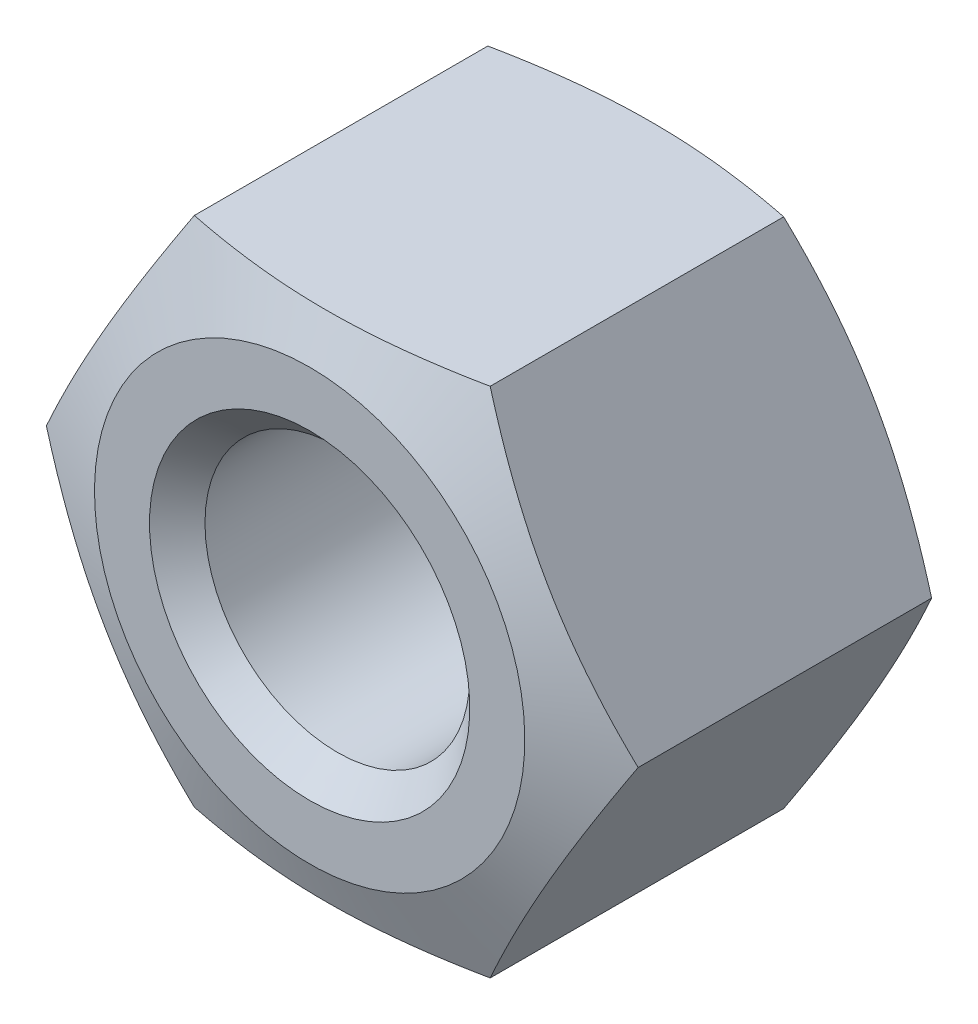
ISO-10303-21;
HEADER;
FILE_DESCRIPTION(('STEP AP214'),'2;1');
FILE_NAME('part.step','',(''),(''),'','','');
FILE_SCHEMA(('AUTOMOTIVE_DESIGN { 1 0 10303 214 1 1 1 1 }'));
ENDSEC;
DATA;
#1=APPLICATION_CONTEXT('core data for automotive mechanical design processes');
#2=APPLICATION_PROTOCOL_DEFINITION('international standard','automotive_design',2000,#1);
#3=PRODUCT_CONTEXT('',#1,'mechanical');
#4=PRODUCT('Part','Part','',(#3));
#5=PRODUCT_RELATED_PRODUCT_CATEGORY('part','',(#4));
#6=PRODUCT_DEFINITION_FORMATION('','',#4);
#7=PRODUCT_DEFINITION_CONTEXT('part definition',#1,'design');
#8=PRODUCT_DEFINITION('design','',#6,#7);
#9=PRODUCT_DEFINITION_SHAPE('','',#8);
#10=(LENGTH_UNIT() NAMED_UNIT(*) SI_UNIT(.MILLI.,.METRE.));
#11=(NAMED_UNIT(*) PLANE_ANGLE_UNIT() SI_UNIT($,.RADIAN.));
#12=(NAMED_UNIT(*) SI_UNIT($,.STERADIAN.) SOLID_ANGLE_UNIT());
#13=UNCERTAINTY_MEASURE_WITH_UNIT(LENGTH_MEASURE(1.E-05),#10,'distance_accuracy_value','');
#14=(GEOMETRIC_REPRESENTATION_CONTEXT(3) GLOBAL_UNCERTAINTY_ASSIGNED_CONTEXT((#13)) GLOBAL_UNIT_ASSIGNED_CONTEXT((#10,
#11,#12)) REPRESENTATION_CONTEXT('',''));
#15=CARTESIAN_POINT('',(0.,0.,0.));
#16=DIRECTION('',(0.,0.,1.));
#17=DIRECTION('',(1.,0.,0.));
#18=AXIS2_PLACEMENT_3D('',#15,#16,#17);
#19=CARTESIAN_POINT('',(0.,0.,0.));
#20=DIRECTION('',(0.,0.,1.));
#21=DIRECTION('',(0.,-1.,0.));
#22=AXIS2_PLACEMENT_3D('',#19,#20,#21);
#23=CONICAL_SURFACE('',#22,3.35875578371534,1.18682389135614);
#24=CARTESIAN_POINT('',(0.,0.,0.));
#25=DIRECTION('',(0.,0.,1.));
#26=DIRECTION('',(1.,0.,0.));
#27=AXIS2_PLACEMENT_3D('',#24,#25,#26);
#28=CIRCLE('',#27,3.35875578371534);
#29=CARTESIAN_POINT('',(3.35875578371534,0.,0.));
#30=VERTEX_POINT('',#29);
#31=EDGE_CURVE('E24',#30,#30,#28,.T.);
#32=ORIENTED_EDGE('',*,*,#31,.T.);
#33=EDGE_LOOP('',(#32));
#34=FACE_BOUND('',#33,.T.);
#35=CARTESIAN_POINT('',(2.30939884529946,4.00000013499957,0.509091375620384));
#36=CARTESIAN_POINT('',(2.39008307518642,3.8602509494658,0.476490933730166));
#37=CARTESIAN_POINT('',(2.47103361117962,3.72004050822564,0.446346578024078));
#38=CARTESIAN_POINT('',(2.63346995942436,3.43869250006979,0.391896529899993));
#39=CARTESIAN_POINT('',(2.71495605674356,3.29755443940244,0.367594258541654));
#40=CARTESIAN_POINT('',(2.87834754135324,3.01455208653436,0.325801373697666));
#41=CARTESIAN_POINT('',(2.96025279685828,2.87268802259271,0.308308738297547));
#42=CARTESIAN_POINT('',(3.12436755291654,2.58843292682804,0.280945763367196));
#43=CARTESIAN_POINT('',(3.20657698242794,2.44604201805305,0.27107374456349));
#44=CARTESIAN_POINT('',(3.3697443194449,2.16342790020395,0.259565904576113));
#45=CARTESIAN_POINT('',(3.45069977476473,2.02320893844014,0.257793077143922));
#46=CARTESIAN_POINT('',(3.61256284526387,1.74285387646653,0.262206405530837));
#47=CARTESIAN_POINT('',(3.69347045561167,1.60271778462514,0.268393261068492));
#48=CARTESIAN_POINT('',(3.85498876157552,1.32295987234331,0.288392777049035));
#49=CARTESIAN_POINT('',(3.93559962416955,1.1833377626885,0.302200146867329));
#50=CARTESIAN_POINT('',(4.09644587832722,0.904743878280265,0.33677333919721));
#51=CARTESIAN_POINT('',(4.1766812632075,0.765772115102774,0.357539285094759));
#52=CARTESIAN_POINT('',(4.28694535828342,0.574789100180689,0.390364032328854));
#53=CARTESIAN_POINT('',(4.31717499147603,0.522429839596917,0.399809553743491));
#54=CARTESIAN_POINT('',(4.37756290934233,0.417834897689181,0.419523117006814));
#55=CARTESIAN_POINT('',(4.40772120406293,0.365599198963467,0.429791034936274));
#56=CARTESIAN_POINT('',(4.46807218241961,0.261068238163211,0.451138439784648));
#57=CARTESIAN_POINT('',(4.49826462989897,0.208773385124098,0.46222058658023));
#58=CARTESIAN_POINT('',(4.55858337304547,0.104298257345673,0.485118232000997));
#59=CARTESIAN_POINT('',(4.58870966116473,0.0521179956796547,0.496933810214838));
#60=CARTESIAN_POINT('',(4.61880115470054,-2.00000000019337E-06,0.509091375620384));
#61=B_SPLINE_CURVE_WITH_KNOTS('',3,(#35,#36,#37,#38,#39,#40,#41,#42,#43,#44,#45,#46,#47,#48,#49,
#50,#51,#52,#53,#54,#55,#56,#57,#58,#59,#60),.UNSPECIFIED.,.F.,.F.,(4,2,2,2,2,2,2,2,2,2,2,2,4),
(0.,0.493920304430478,0.988129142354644,1.48219112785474,1.97614421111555,2.46170985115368,
2.94731817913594,3.4325897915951,3.91787000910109,4.10144449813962,4.2849913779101,
4.46916707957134,4.65336280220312),.UNSPECIFIED.);
#62=CARTESIAN_POINT('',(2.3094,3.99999813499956,0.509090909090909));
#63=VERTEX_POINT('',#62);
#64=CARTESIAN_POINT('',(4.6188,0.,0.509090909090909));
#65=VERTEX_POINT('',#64);
#66=EDGE_CURVE('E197',#63,#65,#61,.T.);
#67=ORIENTED_EDGE('',*,*,#66,.T.);
#68=CARTESIAN_POINT('',(4.61880115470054,2.E-06,0.509091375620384));
#69=CARTESIAN_POINT('',(4.53811692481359,-0.139747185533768,0.476490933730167));
#70=CARTESIAN_POINT('',(4.45716638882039,-0.279957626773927,0.446346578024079));
#71=CARTESIAN_POINT('',(4.29473004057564,-0.561305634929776,0.391896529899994));
#72=CARTESIAN_POINT('',(4.21324394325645,-0.702443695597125,0.367594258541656));
#73=CARTESIAN_POINT('',(4.04985245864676,-0.985446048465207,0.325801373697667));
#74=CARTESIAN_POINT('',(3.96794720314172,-1.12731011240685,0.308308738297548));
#75=CARTESIAN_POINT('',(3.80383244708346,-1.41156520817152,0.280945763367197));
#76=CARTESIAN_POINT('',(3.72162301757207,-1.55395611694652,0.271073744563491));
#77=CARTESIAN_POINT('',(3.5584556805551,-1.83657023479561,0.259565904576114));
#78=CARTESIAN_POINT('',(3.47750022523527,-1.97678919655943,0.257793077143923));
#79=CARTESIAN_POINT('',(3.31563715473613,-2.25714425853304,0.262206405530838));
#80=CARTESIAN_POINT('',(3.23472954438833,-2.39728035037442,0.268393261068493));
#81=CARTESIAN_POINT('',(3.07321123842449,-2.67703826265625,0.288392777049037));
#82=CARTESIAN_POINT('',(2.99260037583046,-2.81666037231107,0.302200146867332));
#83=CARTESIAN_POINT('',(2.83175412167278,-3.0952542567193,0.336773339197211));
#84=CARTESIAN_POINT('',(2.75151873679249,-3.23422601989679,0.357539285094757));
#85=CARTESIAN_POINT('',(2.64125464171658,-3.42520903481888,0.390364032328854));
#86=CARTESIAN_POINT('',(2.61102500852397,-3.47756829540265,0.399809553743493));
#87=CARTESIAN_POINT('',(2.55063709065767,-3.58216323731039,0.419523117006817));
#88=CARTESIAN_POINT('',(2.52047879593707,-3.6343989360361,0.429791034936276));
#89=CARTESIAN_POINT('',(2.46012781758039,-3.73892989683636,0.451138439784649));
#90=CARTESIAN_POINT('',(2.42993537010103,-3.79122474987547,0.462220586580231));
#91=CARTESIAN_POINT('',(2.36961662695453,-3.8956998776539,0.485118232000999));
#92=CARTESIAN_POINT('',(2.33949033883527,-3.94788013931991,0.496933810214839));
#93=CARTESIAN_POINT('',(2.30939884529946,-4.00000013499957,0.509091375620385));
#94=B_SPLINE_CURVE_WITH_KNOTS('',3,(#68,#69,#70,#71,#72,#73,#74,#75,#76,#77,#78,#79,#80,#81,#82,
#83,#84,#85,#86,#87,#88,#89,#90,#91,#92,#93),.UNSPECIFIED.,.F.,.F.,(4,2,2,2,2,2,2,2,2,2,2,2,4),
(0.,0.493920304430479,0.988129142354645,1.48219112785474,1.97614421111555,2.46170985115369,
2.94731817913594,3.43258979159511,3.9178700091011,4.10144449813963,4.2849913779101,
4.46916707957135,4.65336280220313),.UNSPECIFIED.);
#95=CARTESIAN_POINT('',(2.3094,-3.99999813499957,0.509090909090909));
#96=VERTEX_POINT('',#95);
#97=EDGE_CURVE('E36',#65,#96,#94,.T.);
#98=ORIENTED_EDGE('',*,*,#97,.T.);
#99=CARTESIAN_POINT('',(-6.09079392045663,-3.99999813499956,1.58704123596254));
#100=CARTESIAN_POINT('',(-5.91049455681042,-3.99999813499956,1.52616957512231));
#101=CARTESIAN_POINT('',(-5.72995445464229,-3.99999813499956,1.46599775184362));
#102=CARTESIAN_POINT('',(-5.36826822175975,-3.99999813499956,1.34744491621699));
#103=CARTESIAN_POINT('',(-5.18712203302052,-3.99999813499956,1.28906408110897));
#104=CARTESIAN_POINT('',(-4.82369281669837,-3.99999813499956,1.1743570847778));
#105=CARTESIAN_POINT('',(-4.64140809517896,-3.99999813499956,1.11803627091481));
#106=CARTESIAN_POINT('',(-4.27601285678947,-3.99999813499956,1.00814600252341));
#107=CARTESIAN_POINT('',(-4.09290236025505,-3.99999813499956,0.954576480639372));
#108=CARTESIAN_POINT('',(-3.72811891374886,-3.99999813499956,0.851563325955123));
#109=CARTESIAN_POINT('',(-3.54645873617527,-3.99999813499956,0.802074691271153));
#110=CARTESIAN_POINT('',(-3.18204468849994,-3.99999813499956,0.707305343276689));
#111=CARTESIAN_POINT('',(-2.99929086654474,-3.99999813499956,0.662024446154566));
#112=CARTESIAN_POINT('',(-2.63264591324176,-3.99999813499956,0.576752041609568));
#113=CARTESIAN_POINT('',(-2.44875544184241,-3.99999813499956,0.536757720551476));
#114=CARTESIAN_POINT('',(-2.0796684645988,-3.99999813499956,0.463301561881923));
#115=CARTESIAN_POINT('',(-1.8944720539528,-3.99999813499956,0.429839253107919));
#116=CARTESIAN_POINT('',(-1.56082733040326,-3.99999813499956,0.376887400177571));
#117=CARTESIAN_POINT('',(-1.41261159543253,-3.99999813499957,0.355939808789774));
#118=CARTESIAN_POINT('',(-1.11548693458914,-3.99999813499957,0.319768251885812));
#119=CARTESIAN_POINT('',(-0.966578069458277,-3.99999813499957,0.304543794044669));
#120=CARTESIAN_POINT('',(-0.668334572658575,-3.99999813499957,0.2804193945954));
#121=CARTESIAN_POINT('',(-0.519000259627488,-3.99999813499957,0.271515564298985));
#122=CARTESIAN_POINT('',(-0.220080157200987,-3.99999813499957,0.260406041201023));
#123=CARTESIAN_POINT('',(-0.0704943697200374,-3.99999813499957,0.258200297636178));
#124=CARTESIAN_POINT('',(0.229369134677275,-3.99999813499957,0.26059446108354));
#125=CARTESIAN_POINT('',(0.379646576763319,-3.99999813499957,0.265228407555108));
#126=CARTESIAN_POINT('',(0.679845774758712,-3.99999813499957,0.281151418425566));
#127=CARTESIAN_POINT('',(0.829767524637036,-3.99999813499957,0.292440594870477));
#128=CARTESIAN_POINT('',(1.12910609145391,-3.99999813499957,0.321201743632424));
#129=CARTESIAN_POINT('',(1.27852252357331,-3.99999813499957,0.338677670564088));
#130=CARTESIAN_POINT('',(1.57659491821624,-3.99999813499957,0.379155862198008));
#131=CARTESIAN_POINT('',(1.72525088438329,-3.99999813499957,0.402158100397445));
#132=CARTESIAN_POINT('',(2.04945169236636,-3.99999813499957,0.457714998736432));
#133=CARTESIAN_POINT('',(2.22482722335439,-3.99999813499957,0.491251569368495));
#134=CARTESIAN_POINT('',(2.57442005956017,-3.99999813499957,0.563911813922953));
#135=CARTESIAN_POINT('',(2.7486372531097,-3.99999813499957,0.603036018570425));
#136=CARTESIAN_POINT('',(3.09607425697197,-3.99999813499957,0.685844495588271));
#137=CARTESIAN_POINT('',(3.26929348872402,-3.99999813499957,0.729531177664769));
#138=CARTESIAN_POINT('',(3.61475266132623,-3.99999813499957,0.820570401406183));
#139=CARTESIAN_POINT('',(3.78699264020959,-3.99999813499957,0.867922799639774));
#140=CARTESIAN_POINT('',(4.13108927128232,-3.99999813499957,0.96571729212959));
#141=CARTESIAN_POINT('',(4.30294365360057,-3.99999813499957,1.01616733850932));
#142=CARTESIAN_POINT('',(4.64592612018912,-3.99999813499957,1.11948029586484));
#143=CARTESIAN_POINT('',(4.81705419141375,-3.99999813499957,1.17234324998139));
#144=CARTESIAN_POINT('',(5.32941352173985,-3.99999813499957,1.33382311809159));
#145=CARTESIAN_POINT('',(5.66972324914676,-3.99999813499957,1.44536103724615));
#146=CARTESIAN_POINT('',(6.34603736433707,-3.99999813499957,1.67283562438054));
#147=CARTESIAN_POINT('',(6.68205495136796,-3.99999813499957,1.78873343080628));
#148=CARTESIAN_POINT('',(7.35283375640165,-3.99999813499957,2.0241845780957));
#149=CARTESIAN_POINT('',(7.68759487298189,-3.99999813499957,2.14373820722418));
#150=CARTESIAN_POINT('',(8.35391751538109,-3.99999813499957,2.38465642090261));
#151=CARTESIAN_POINT('',(8.68548542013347,-3.99999813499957,2.50600342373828));
#152=CARTESIAN_POINT('',(9.34785200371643,-3.99999813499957,2.75064899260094));
#153=CARTESIAN_POINT('',(9.67865077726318,-3.99999813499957,2.87394730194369));
#154=CARTESIAN_POINT('',(10.0091931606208,-3.99999813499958,2.99791876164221));
#155=B_SPLINE_CURVE_WITH_KNOTS('',3,(#99,#100,#101,#102,#103,#104,#105,#106,#107,#108,#109,#110,
#111,#112,#113,#114,#115,#116,#117,#118,#119,#120,#121,#122,#123,#124,#125,#126,#127,#128,#129,
#130,#131,#132,#133,#134,#135,#136,#137,#138,#139,#140,#141,#142,#143,#144,#145,#146,#147,#148,
#149,#150,#151,#152,#153,#154),.UNSPECIFIED.,.F.,.F.,(4,2,2,2,2,2,2,2,2,2,2,2,2,2,2,2,2,2,2,2,2,
2,2,2,2,2,2,4),(0.,0.570898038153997,1.14185239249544,1.71419655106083,2.28652669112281,
2.85132862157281,3.41610586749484,3.98058130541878,4.54501601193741,4.99398614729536,
5.44291765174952,5.89157271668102,6.34022438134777,6.79111641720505,7.24201604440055,
7.69320441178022,8.14439061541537,8.6799357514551,9.21553178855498,9.75141214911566,
10.2872715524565,10.8245692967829,11.3618766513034,12.4361685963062,13.5024747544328,
14.5688652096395,15.6280853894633,16.6871673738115),.UNSPECIFIED.);
#156=CARTESIAN_POINT('',(-2.3094,-3.99999813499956,0.509090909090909));
#157=VERTEX_POINT('',#156);
#158=EDGE_CURVE('E91',#96,#157,#155,.F.);
#159=ORIENTED_EDGE('',*,*,#158,.T.);
#160=CARTESIAN_POINT('',(-2.30939884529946,-4.00000013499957,0.509091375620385));
#161=CARTESIAN_POINT('',(-2.39008307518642,-3.8602509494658,0.476490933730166));
#162=CARTESIAN_POINT('',(-2.47103361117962,-3.72004050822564,0.446346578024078));
#163=CARTESIAN_POINT('',(-2.63346995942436,-3.43869250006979,0.391896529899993));
#164=CARTESIAN_POINT('',(-2.71495605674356,-3.29755443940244,0.367594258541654));
#165=CARTESIAN_POINT('',(-2.87834754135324,-3.01455208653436,0.325801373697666));
#166=CARTESIAN_POINT('',(-2.96025279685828,-2.87268802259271,0.308308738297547));
#167=CARTESIAN_POINT('',(-3.12436755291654,-2.58843292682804,0.280945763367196));
#168=CARTESIAN_POINT('',(-3.20657698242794,-2.44604201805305,0.27107374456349));
#169=CARTESIAN_POINT('',(-3.3697443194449,-2.16342790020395,0.259565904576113));
#170=CARTESIAN_POINT('',(-3.45069977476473,-2.02320893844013,0.257793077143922));
#171=CARTESIAN_POINT('',(-3.61256284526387,-1.74285387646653,0.262206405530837));
#172=CARTESIAN_POINT('',(-3.69347045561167,-1.60271778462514,0.268393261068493));
#173=CARTESIAN_POINT('',(-3.85498876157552,-1.32295987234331,0.288392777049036));
#174=CARTESIAN_POINT('',(-3.93559962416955,-1.18333776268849,0.30220014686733));
#175=CARTESIAN_POINT('',(-4.09644587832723,-0.904743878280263,0.336773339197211));
#176=CARTESIAN_POINT('',(-4.17668126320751,-0.765772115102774,0.357539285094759));
#177=CARTESIAN_POINT('',(-4.28694535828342,-0.574789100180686,0.390364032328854));
#178=CARTESIAN_POINT('',(-4.31717499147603,-0.522429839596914,0.399809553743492));
#179=CARTESIAN_POINT('',(-4.37756290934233,-0.417834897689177,0.419523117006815));
#180=CARTESIAN_POINT('',(-4.40772120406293,-0.365599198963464,0.429791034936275));
#181=CARTESIAN_POINT('',(-4.46807218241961,-0.261068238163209,0.451138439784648));
#182=CARTESIAN_POINT('',(-4.49826462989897,-0.208773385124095,0.46222058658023));
#183=CARTESIAN_POINT('',(-4.55858337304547,-0.10429825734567,0.485118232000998));
#184=CARTESIAN_POINT('',(-4.58870966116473,-0.0521179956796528,0.496933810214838));
#185=CARTESIAN_POINT('',(-4.61880115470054,2.00000000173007E-06,0.509091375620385));
#186=B_SPLINE_CURVE_WITH_KNOTS('',3,(#160,#161,#162,#163,#164,#165,#166,#167,#168,#169,#170,
#171,#172,#173,#174,#175,#176,#177,#178,#179,#180,#181,#182,#183,#184,#185),.UNSPECIFIED.,.F.,
.F.,(4,2,2,2,2,2,2,2,2,2,2,2,4),(0.,0.493920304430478,0.988129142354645,1.48219112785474,
1.97614421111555,2.46170985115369,2.94731817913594,3.4325897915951,3.9178700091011,
4.10144449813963,4.2849913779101,4.46916707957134,4.65336280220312),.UNSPECIFIED.);
#187=CARTESIAN_POINT('',(-4.6188,0.,0.509090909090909));
#188=VERTEX_POINT('',#187);
#189=EDGE_CURVE('E102',#157,#188,#186,.T.);
#190=ORIENTED_EDGE('',*,*,#189,.T.);
#191=CARTESIAN_POINT('',(-4.61880115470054,-1.99999999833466E-06,0.509091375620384));
#192=CARTESIAN_POINT('',(-4.53811692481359,0.139747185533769,0.476490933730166));
#193=CARTESIAN_POINT('',(-4.45716638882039,0.279957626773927,0.446346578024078));
#194=CARTESIAN_POINT('',(-4.29473004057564,0.561305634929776,0.391896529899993));
#195=CARTESIAN_POINT('',(-4.21324394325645,0.702443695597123,0.367594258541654));
#196=CARTESIAN_POINT('',(-4.04985245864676,0.985446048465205,0.325801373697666));
#197=CARTESIAN_POINT('',(-3.96794720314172,1.12731011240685,0.308308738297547));
#198=CARTESIAN_POINT('',(-3.80383244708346,1.41156520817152,0.280945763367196));
#199=CARTESIAN_POINT('',(-3.72162301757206,1.55395611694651,0.27107374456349));
#200=CARTESIAN_POINT('',(-3.5584556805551,1.83657023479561,0.259565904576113));
#201=CARTESIAN_POINT('',(-3.47750022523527,1.97678919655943,0.257793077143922));
#202=CARTESIAN_POINT('',(-3.31563715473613,2.25714425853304,0.262206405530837));
#203=CARTESIAN_POINT('',(-3.23472954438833,2.39728035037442,0.268393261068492));
#204=CARTESIAN_POINT('',(-3.07321123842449,2.67703826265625,0.288392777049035));
#205=CARTESIAN_POINT('',(-2.99260037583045,2.81666037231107,0.302200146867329));
#206=CARTESIAN_POINT('',(-2.83175412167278,3.0952542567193,0.33677333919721));
#207=CARTESIAN_POINT('',(-2.7515187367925,3.23422601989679,0.357539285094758));
#208=CARTESIAN_POINT('',(-2.64125464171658,3.42520903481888,0.390364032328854));
#209=CARTESIAN_POINT('',(-2.61102500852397,3.47756829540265,0.399809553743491));
#210=CARTESIAN_POINT('',(-2.55063709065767,3.58216323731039,0.419523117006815));
#211=CARTESIAN_POINT('',(-2.52047879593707,3.6343989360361,0.429791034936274));
#212=CARTESIAN_POINT('',(-2.46012781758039,3.73892989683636,0.451138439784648));
#213=CARTESIAN_POINT('',(-2.42993537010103,3.79122474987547,0.462220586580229));
#214=CARTESIAN_POINT('',(-2.36961662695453,3.89569987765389,0.485118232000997));
#215=CARTESIAN_POINT('',(-2.33949033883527,3.94788013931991,0.496933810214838));
#216=CARTESIAN_POINT('',(-2.30939884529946,4.00000013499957,0.509091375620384));
#217=B_SPLINE_CURVE_WITH_KNOTS('',3,(#191,#192,#193,#194,#195,#196,#197,#198,#199,#200,#201,
#202,#203,#204,#205,#206,#207,#208,#209,#210,#211,#212,#213,#214,#215,#216),.UNSPECIFIED.,.F.,
.F.,(4,2,2,2,2,2,2,2,2,2,2,2,4),(0.,0.493920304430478,0.988129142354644,1.48219112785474,
1.97614421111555,2.46170985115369,2.94731817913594,3.4325897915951,3.91787000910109,
4.10144449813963,4.2849913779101,4.46916707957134,4.65336280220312),.UNSPECIFIED.);
#218=CARTESIAN_POINT('',(-2.3094,3.99999813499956,0.509090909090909));
#219=VERTEX_POINT('',#218);
#220=EDGE_CURVE('E108',#188,#219,#217,.T.);
#221=ORIENTED_EDGE('',*,*,#220,.T.);
#222=CARTESIAN_POINT('',(-6.09079392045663,3.99999813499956,1.58704123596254));
#223=CARTESIAN_POINT('',(-5.91049455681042,3.99999813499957,1.52616957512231));
#224=CARTESIAN_POINT('',(-5.72995445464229,3.99999813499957,1.46599775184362));
#225=CARTESIAN_POINT('',(-5.36826822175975,3.99999813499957,1.34744491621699));
#226=CARTESIAN_POINT('',(-5.18712203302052,3.99999813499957,1.28906408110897));
#227=CARTESIAN_POINT('',(-4.82369281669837,3.99999813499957,1.1743570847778));
#228=CARTESIAN_POINT('',(-4.64140809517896,3.99999813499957,1.11803627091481));
#229=CARTESIAN_POINT('',(-4.27601285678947,3.99999813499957,1.00814600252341));
#230=CARTESIAN_POINT('',(-4.09290236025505,3.99999813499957,0.954576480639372));
#231=CARTESIAN_POINT('',(-3.72811891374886,3.99999813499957,0.851563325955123));
#232=CARTESIAN_POINT('',(-3.54645873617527,3.99999813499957,0.802074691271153));
#233=CARTESIAN_POINT('',(-3.18204468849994,3.99999813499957,0.707305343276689));
#234=CARTESIAN_POINT('',(-2.99929086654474,3.99999813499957,0.662024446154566));
#235=CARTESIAN_POINT('',(-2.63264591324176,3.99999813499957,0.576752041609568));
#236=CARTESIAN_POINT('',(-2.44875544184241,3.99999813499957,0.536757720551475));
#237=CARTESIAN_POINT('',(-2.07966846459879,3.99999813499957,0.463301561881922));
#238=CARTESIAN_POINT('',(-1.8944720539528,3.99999813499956,0.429839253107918));
#239=CARTESIAN_POINT('',(-1.56082733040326,3.99999813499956,0.37688740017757));
#240=CARTESIAN_POINT('',(-1.41261159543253,3.99999813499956,0.355939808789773));
#241=CARTESIAN_POINT('',(-1.11548693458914,3.99999813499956,0.319768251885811));
#242=CARTESIAN_POINT('',(-0.966578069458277,3.99999813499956,0.304543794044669));
#243=CARTESIAN_POINT('',(-0.668334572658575,3.99999813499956,0.280419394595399));
#244=CARTESIAN_POINT('',(-0.519000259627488,3.99999813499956,0.271515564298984));
#245=CARTESIAN_POINT('',(-0.220080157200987,3.99999813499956,0.260406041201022));
#246=CARTESIAN_POINT('',(-0.0704943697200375,3.99999813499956,0.258200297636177));
#247=CARTESIAN_POINT('',(0.229369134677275,3.99999813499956,0.260594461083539));
#248=CARTESIAN_POINT('',(0.37964657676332,3.99999813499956,0.265228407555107));
#249=CARTESIAN_POINT('',(0.679845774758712,3.99999813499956,0.281151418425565));
#250=CARTESIAN_POINT('',(0.829767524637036,3.99999813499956,0.292440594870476));
#251=CARTESIAN_POINT('',(1.12910609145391,3.99999813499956,0.321201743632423));
#252=CARTESIAN_POINT('',(1.27852252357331,3.99999813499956,0.338677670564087));
#253=CARTESIAN_POINT('',(1.57659491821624,3.99999813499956,0.379155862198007));
#254=CARTESIAN_POINT('',(1.72525088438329,3.99999813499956,0.402158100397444));
#255=CARTESIAN_POINT('',(2.04945169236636,3.99999813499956,0.457714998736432));
#256=CARTESIAN_POINT('',(2.2248272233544,3.99999813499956,0.491251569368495));
#257=CARTESIAN_POINT('',(2.57442005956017,3.99999813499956,0.563911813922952));
#258=CARTESIAN_POINT('',(2.7486372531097,3.99999813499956,0.603036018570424));
#259=CARTESIAN_POINT('',(3.09607425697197,3.99999813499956,0.68584449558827));
#260=CARTESIAN_POINT('',(3.26929348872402,3.99999813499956,0.729531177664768));
#261=CARTESIAN_POINT('',(3.61475266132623,3.99999813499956,0.820570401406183));
#262=CARTESIAN_POINT('',(3.78699264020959,3.99999813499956,0.867922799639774));
#263=CARTESIAN_POINT('',(4.13108927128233,3.99999813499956,0.965717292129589));
#264=CARTESIAN_POINT('',(4.30294365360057,3.99999813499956,1.01616733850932));
#265=CARTESIAN_POINT('',(4.64592612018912,3.99999813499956,1.11948029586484));
#266=CARTESIAN_POINT('',(4.81705419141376,3.99999813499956,1.17234324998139));
#267=CARTESIAN_POINT('',(5.32941352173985,3.99999813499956,1.33382311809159));
#268=CARTESIAN_POINT('',(5.66972324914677,3.99999813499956,1.44536103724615));
#269=CARTESIAN_POINT('',(6.34603736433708,3.99999813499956,1.67283562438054));
#270=CARTESIAN_POINT('',(6.68205495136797,3.99999813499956,1.78873343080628));
#271=CARTESIAN_POINT('',(7.35283375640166,3.99999813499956,2.0241845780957));
#272=CARTESIAN_POINT('',(7.68759487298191,3.99999813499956,2.14373820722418));
#273=CARTESIAN_POINT('',(8.3539175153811,3.99999813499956,2.38465642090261));
#274=CARTESIAN_POINT('',(8.68548542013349,3.99999813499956,2.50600342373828));
#275=CARTESIAN_POINT('',(9.34785200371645,3.99999813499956,2.75064899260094));
#276=CARTESIAN_POINT('',(9.6786507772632,3.99999813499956,2.87394730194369));
#277=CARTESIAN_POINT('',(10.0091931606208,3.99999813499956,2.99791876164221));
#278=B_SPLINE_CURVE_WITH_KNOTS('',3,(#222,#223,#224,#225,#226,#227,#228,#229,#230,#231,#232,
#233,#234,#235,#236,#237,#238,#239,#240,#241,#242,#243,#244,#245,#246,#247,#248,#249,#250,#251,
#252,#253,#254,#255,#256,#257,#258,#259,#260,#261,#262,#263,#264,#265,#266,#267,#268,#269,#270,
#271,#272,#273,#274,#275,#276,#277),.UNSPECIFIED.,.F.,.F.,(4,2,2,2,2,2,2,2,2,2,2,2,2,2,2,2,2,2,
2,2,2,2,2,2,2,2,2,4),(0.,0.570898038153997,1.14185239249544,1.71419655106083,2.28652669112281,
2.85132862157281,3.41610586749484,3.98058130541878,4.54501601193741,4.99398614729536,
5.44291765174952,5.89157271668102,6.34022438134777,6.79111641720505,7.24201604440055,
7.69320441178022,8.14439061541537,8.6799357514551,9.21553178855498,9.75141214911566,
10.2872715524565,10.8245692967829,11.3618766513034,12.4361685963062,13.5024747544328,
14.5688652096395,15.6280853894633,16.6871673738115),.UNSPECIFIED.);
#279=EDGE_CURVE('E203',#219,#63,#278,.T.);
#280=ORIENTED_EDGE('',*,*,#279,.T.);
#281=EDGE_LOOP('',(#67,#98,#159,#190,#221,#280));
#282=FACE_BOUND('',#281,.T.);
#283=ADVANCED_FACE('F14',(#34,#282),#23,.T.);
#284=CARTESIAN_POINT('',(4.6188,0.,0.));
#285=DIRECTION('',(0.,0.,1.));
#286=DIRECTION('',(1.,0.,0.));
#287=AXIS2_PLACEMENT_3D('',#284,#285,#286);
#288=PLANE('',#287);
#289=CARTESIAN_POINT('',(0.,0.,0.));
#290=DIRECTION('',(0.,0.,1.));
#291=DIRECTION('',(1.,0.,0.));
#292=AXIS2_PLACEMENT_3D('',#289,#290,#291);
#293=CIRCLE('',#292,2.5);
#294=CARTESIAN_POINT('',(2.5,0.,0.));
#295=VERTEX_POINT('',#294);
#296=EDGE_CURVE('E9',#295,#295,#293,.F.);
#297=ORIENTED_EDGE('',*,*,#296,.F.);
#298=EDGE_LOOP('',(#297));
#299=FACE_BOUND('',#298,.T.);
#300=ORIENTED_EDGE('',*,*,#31,.F.);
#301=EDGE_LOOP('',(#300));
#302=FACE_BOUND('',#301,.T.);
#303=ADVANCED_FACE('F225',(#299,#302),#288,.F.);
#304=CARTESIAN_POINT('',(0.,0.,5.6));
#305=DIRECTION('',(0.,0.,1.));
#306=DIRECTION('',(0.,-1.,0.));
#307=AXIS2_PLACEMENT_3D('',#304,#305,#306);
#308=CONICAL_SURFACE('',#307,2.5,0.785398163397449);
#309=CARTESIAN_POINT('',(0.,0.,5.167));
#310=DIRECTION('',(0.,0.,-1.));
#311=DIRECTION('',(0.,1.,0.));
#312=AXIS2_PLACEMENT_3D('',#309,#310,#311);
#313=CIRCLE('',#312,2.067);
#314=CARTESIAN_POINT('',(0.,2.067,5.167));
#315=VERTEX_POINT('',#314);
#316=EDGE_CURVE('E324',#315,#315,#313,.T.);
#317=ORIENTED_EDGE('',*,*,#316,.T.);
#318=EDGE_LOOP('',(#317));
#319=FACE_BOUND('',#318,.T.);
#320=CARTESIAN_POINT('',(0.,0.,5.6));
#321=DIRECTION('',(0.,0.,-1.));
#322=DIRECTION('',(0.,1.,0.));
#323=AXIS2_PLACEMENT_3D('',#320,#321,#322);
#324=CIRCLE('',#323,2.5);
#325=CARTESIAN_POINT('',(0.,2.5,5.6));
#326=VERTEX_POINT('',#325);
#327=EDGE_CURVE('E118',#326,#326,#324,.T.);
#328=ORIENTED_EDGE('',*,*,#327,.F.);
#329=EDGE_LOOP('',(#328));
#330=FACE_BOUND('',#329,.T.);
#331=ADVANCED_FACE('F163',(#319,#330),#308,.F.);
#332=CARTESIAN_POINT('',(0.,0.,0.));
#333=DIRECTION('',(0.,0.,-1.));
#334=DIRECTION('',(0.,1.,0.));
#335=AXIS2_PLACEMENT_3D('',#332,#333,#334);
#336=CYLINDRICAL_SURFACE('',#335,2.067);
#337=CARTESIAN_POINT('',(0.,0.,0.433));
#338=DIRECTION('',(0.,0.,-1.));
#339=DIRECTION('',(0.,1.,0.));
#340=AXIS2_PLACEMENT_3D('',#337,#338,#339);
#341=CIRCLE('',#340,2.067);
#342=CARTESIAN_POINT('',(0.,2.067,0.433));
#343=VERTEX_POINT('',#342);
#344=EDGE_CURVE('E327',#343,#343,#341,.T.);
#345=ORIENTED_EDGE('',*,*,#344,.T.);
#346=EDGE_LOOP('',(#345));
#347=FACE_BOUND('',#346,.T.);
#348=ORIENTED_EDGE('',*,*,#316,.F.);
#349=EDGE_LOOP('',(#348));
#350=FACE_BOUND('',#349,.T.);
#351=ADVANCED_FACE('F297',(#347,#350),#336,.F.);
#352=CARTESIAN_POINT('',(0.,0.,0.433));
#353=DIRECTION('',(0.,0.,-1.));
#354=DIRECTION('',(0.,1.,0.));
#355=AXIS2_PLACEMENT_3D('',#352,#353,#354);
#356=CONICAL_SURFACE('',#355,2.067,0.785398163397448);
#357=ORIENTED_EDGE('',*,*,#296,.T.);
#358=EDGE_LOOP('',(#357));
#359=FACE_BOUND('',#358,.T.);
#360=ORIENTED_EDGE('',*,*,#344,.F.);
#361=EDGE_LOOP('',(#360));
#362=FACE_BOUND('',#361,.T.);
#363=ADVANCED_FACE('F288',(#359,#362),#356,.F.);
#364=CARTESIAN_POINT('',(4.6188,0.,5.6));
#365=DIRECTION('',(0.,0.,1.));
#366=DIRECTION('',(1.,0.,0.));
#367=AXIS2_PLACEMENT_3D('',#364,#365,#366);
#368=PLANE('',#367);
#369=CARTESIAN_POINT('',(0.,0.,5.6));
#370=DIRECTION('',(0.,0.,-1.));
#371=DIRECTION('',(0.,1.,0.));
#372=AXIS2_PLACEMENT_3D('',#369,#370,#371);
#373=CIRCLE('',#372,3.35875578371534);
#374=CARTESIAN_POINT('',(0.,3.35875578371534,5.6));
#375=VERTEX_POINT('',#374);
#376=EDGE_CURVE('E112',#375,#375,#373,.T.);
#377=ORIENTED_EDGE('',*,*,#376,.F.);
#378=EDGE_LOOP('',(#377));
#379=FACE_BOUND('',#378,.T.);
#380=ORIENTED_EDGE('',*,*,#327,.T.);
#381=EDGE_LOOP('',(#380));
#382=FACE_BOUND('',#381,.T.);
#383=ADVANCED_FACE('F137',(#379,#382),#368,.T.);
#384=CARTESIAN_POINT('',(0.,0.,5.09090909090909));
#385=DIRECTION('',(0.,0.,-1.));
#386=DIRECTION('',(0.,1.,0.));
#387=AXIS2_PLACEMENT_3D('',#384,#385,#386);
#388=CONICAL_SURFACE('',#387,4.6188,1.18682389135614);
#389=ORIENTED_EDGE('',*,*,#376,.T.);
#390=EDGE_LOOP('',(#389));
#391=FACE_BOUND('',#390,.T.);
#392=CARTESIAN_POINT('',(-6.09079392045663,-3.99999813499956,4.01295876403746));
#393=CARTESIAN_POINT('',(-5.91049455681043,-3.99999813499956,4.0738304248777));
#394=CARTESIAN_POINT('',(-5.72995445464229,-3.99999813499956,4.13400224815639));
#395=CARTESIAN_POINT('',(-5.36826822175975,-3.99999813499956,4.25255508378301));
#396=CARTESIAN_POINT('',(-5.18712203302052,-3.99999813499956,4.31093591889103));
#397=CARTESIAN_POINT('',(-4.82369281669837,-3.99999813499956,4.4256429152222));
#398=CARTESIAN_POINT('',(-4.64140809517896,-3.99999813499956,4.48196372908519));
#399=CARTESIAN_POINT('',(-4.27601285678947,-3.99999813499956,4.59185399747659));
#400=CARTESIAN_POINT('',(-4.09290236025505,-3.99999813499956,4.64542351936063));
#401=CARTESIAN_POINT('',(-3.72811891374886,-3.99999813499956,4.74843667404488));
#402=CARTESIAN_POINT('',(-3.54645873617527,-3.99999813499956,4.79792530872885));
#403=CARTESIAN_POINT('',(-3.18204468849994,-3.99999813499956,4.89269465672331));
#404=CARTESIAN_POINT('',(-2.99929086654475,-3.99999813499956,4.93797555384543));
#405=CARTESIAN_POINT('',(-2.63264591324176,-3.99999813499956,5.02324795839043));
#406=CARTESIAN_POINT('',(-2.44875544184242,-3.99999813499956,5.06324227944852));
#407=CARTESIAN_POINT('',(-2.0796684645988,-3.99999813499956,5.13669843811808));
#408=CARTESIAN_POINT('',(-1.8944720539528,-3.99999813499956,5.17016074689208));
#409=CARTESIAN_POINT('',(-1.56082733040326,-3.99999813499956,5.22311259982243));
#410=CARTESIAN_POINT('',(-1.41261159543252,-3.99999813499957,5.24406019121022));
#411=CARTESIAN_POINT('',(-1.11548693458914,-3.99999813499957,5.28023174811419));
#412=CARTESIAN_POINT('',(-0.966578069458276,-3.99999813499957,5.29545620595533));
#413=CARTESIAN_POINT('',(-0.668334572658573,-3.99999813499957,5.3195806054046));
#414=CARTESIAN_POINT('',(-0.519000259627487,-3.99999813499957,5.32848443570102));
#415=CARTESIAN_POINT('',(-0.220080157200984,-3.99999813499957,5.33959395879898));
#416=CARTESIAN_POINT('',(-0.0704943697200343,-3.99999813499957,5.34179970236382));
#417=CARTESIAN_POINT('',(0.229369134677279,-3.99999813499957,5.33940553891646));
#418=CARTESIAN_POINT('',(0.379646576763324,-3.99999813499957,5.33477159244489));
#419=CARTESIAN_POINT('',(0.679845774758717,-3.99999813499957,5.31884858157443));
#420=CARTESIAN_POINT('',(0.829767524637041,-3.99999813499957,5.30755940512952));
#421=CARTESIAN_POINT('',(1.12910609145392,-3.99999813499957,5.27879825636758));
#422=CARTESIAN_POINT('',(1.27852252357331,-3.99999813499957,5.26132232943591));
#423=CARTESIAN_POINT('',(1.57659491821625,-3.99999813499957,5.22084413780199));
#424=CARTESIAN_POINT('',(1.7252508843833,-3.99999813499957,5.19784189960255));
#425=CARTESIAN_POINT('',(2.04945169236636,-3.99999813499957,5.14228500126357));
#426=CARTESIAN_POINT('',(2.2248272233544,-3.99999813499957,5.1087484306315));
#427=CARTESIAN_POINT('',(2.57442005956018,-3.99999813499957,5.03608818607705));
#428=CARTESIAN_POINT('',(2.74863725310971,-3.99999813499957,4.99696398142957));
#429=CARTESIAN_POINT('',(3.09607425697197,-3.99999813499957,4.91415550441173));
#430=CARTESIAN_POINT('',(3.26929348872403,-3.99999813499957,4.87046882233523));
#431=CARTESIAN_POINT('',(3.61475266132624,-3.99999813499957,4.77942959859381));
#432=CARTESIAN_POINT('',(3.78699264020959,-3.99999813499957,4.73207720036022));
#433=CARTESIAN_POINT('',(4.13108927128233,-3.99999813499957,4.63428270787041));
#434=CARTESIAN_POINT('',(4.30294365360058,-3.99999813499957,4.58383266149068));
#435=CARTESIAN_POINT('',(4.64592612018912,-3.99999813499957,4.48051970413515));
#436=CARTESIAN_POINT('',(4.81705419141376,-3.99999813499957,4.42765675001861));
#437=CARTESIAN_POINT('',(5.32941352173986,-3.99999813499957,4.26617688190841));
#438=CARTESIAN_POINT('',(5.66972324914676,-3.99999813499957,4.15463896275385));
#439=CARTESIAN_POINT('',(6.34603736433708,-3.99999813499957,3.92716437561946));
#440=CARTESIAN_POINT('',(6.68205495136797,-3.99999813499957,3.81126656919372));
#441=CARTESIAN_POINT('',(7.35283375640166,-3.99999813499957,3.5758154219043));
#442=CARTESIAN_POINT('',(7.6875948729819,-3.99999813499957,3.45626179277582));
#443=CARTESIAN_POINT('',(8.3539175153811,-3.99999813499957,3.21534357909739));
#444=CARTESIAN_POINT('',(8.68548542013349,-3.99999813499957,3.09399657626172));
#445=CARTESIAN_POINT('',(9.34785200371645,-3.99999813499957,2.84935100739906));
#446=CARTESIAN_POINT('',(9.6786507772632,-3.99999813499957,2.72605269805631));
#447=CARTESIAN_POINT('',(10.0091931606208,-3.99999813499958,2.60208123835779));
#448=B_SPLINE_CURVE_WITH_KNOTS('',3,(#392,#393,#394,#395,#396,#397,#398,#399,#400,#401,#402,
#403,#404,#405,#406,#407,#408,#409,#410,#411,#412,#413,#414,#415,#416,#417,#418,#419,#420,#421,
#422,#423,#424,#425,#426,#427,#428,#429,#430,#431,#432,#433,#434,#435,#436,#437,#438,#439,#440,
#441,#442,#443,#444,#445,#446,#447),.UNSPECIFIED.,.F.,.F.,(4,2,2,2,2,2,2,2,2,2,2,2,2,2,2,2,2,2,
2,2,2,2,2,2,2,2,2,4),(0.,0.570898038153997,1.14185239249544,1.71419655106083,2.28652669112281,
2.85132862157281,3.41610586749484,3.98058130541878,4.54501601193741,4.99398614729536,
5.44291765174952,5.89157271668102,6.34022438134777,6.79111641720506,7.24201604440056,
7.69320441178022,8.14439061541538,8.6799357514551,9.21553178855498,9.75141214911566,
10.2872715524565,10.8245692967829,11.3618766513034,12.4361685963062,13.5024747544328,
14.5688652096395,15.6280853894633,16.6871673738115),.UNSPECIFIED.);
#449=CARTESIAN_POINT('',(-2.3094,-3.99999813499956,5.09090909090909));
#450=VERTEX_POINT('',#449);
#451=CARTESIAN_POINT('',(2.3094,-3.99999813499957,5.09090909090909));
#452=VERTEX_POINT('',#451);
#453=EDGE_CURVE('E93',#450,#452,#448,.T.);
#454=ORIENTED_EDGE('',*,*,#453,.T.);
#455=CARTESIAN_POINT('',(2.30939884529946,-4.00000013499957,5.09090862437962));
#456=CARTESIAN_POINT('',(2.39008307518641,-3.8602509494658,5.12350906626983));
#457=CARTESIAN_POINT('',(2.47103361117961,-3.72004050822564,5.15365342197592));
#458=CARTESIAN_POINT('',(2.63346995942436,-3.43869250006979,5.2081034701));
#459=CARTESIAN_POINT('',(2.71495605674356,-3.29755443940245,5.23240574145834));
#460=CARTESIAN_POINT('',(2.87834754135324,-3.01455208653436,5.27419862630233));
#461=CARTESIAN_POINT('',(2.96025279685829,-2.87268802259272,5.29169126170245));
#462=CARTESIAN_POINT('',(3.12436755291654,-2.58843292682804,5.3190542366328));
#463=CARTESIAN_POINT('',(3.20657698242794,-2.44604201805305,5.32892625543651));
#464=CARTESIAN_POINT('',(3.3697443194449,-2.16342790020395,5.34043409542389));
#465=CARTESIAN_POINT('',(3.45069977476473,-2.02320893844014,5.34220692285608));
#466=CARTESIAN_POINT('',(3.61256284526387,-1.74285387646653,5.33779359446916));
#467=CARTESIAN_POINT('',(3.69347045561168,-1.60271778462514,5.33160673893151));
#468=CARTESIAN_POINT('',(3.85498876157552,-1.32295987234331,5.31160722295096));
#469=CARTESIAN_POINT('',(3.93559962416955,-1.1833377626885,5.29779985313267));
#470=CARTESIAN_POINT('',(4.09644587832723,-0.904743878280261,5.26322666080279));
#471=CARTESIAN_POINT('',(4.17668126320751,-0.765772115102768,5.24246071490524));
#472=CARTESIAN_POINT('',(4.28694535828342,-0.574789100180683,5.20963596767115));
#473=CARTESIAN_POINT('',(4.31717499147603,-0.522429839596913,5.20019044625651));
#474=CARTESIAN_POINT('',(4.37756290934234,-0.417834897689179,5.18047688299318));
#475=CARTESIAN_POINT('',(4.40772120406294,-0.365599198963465,5.17020896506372));
#476=CARTESIAN_POINT('',(4.46807218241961,-0.261068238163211,5.14886156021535));
#477=CARTESIAN_POINT('',(4.49826462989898,-0.208773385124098,5.13777941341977));
#478=CARTESIAN_POINT('',(4.55858337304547,-0.104298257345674,5.114881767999));
#479=CARTESIAN_POINT('',(4.58870966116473,-0.0521179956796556,5.10306618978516));
#480=CARTESIAN_POINT('',(4.61880115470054,2.00000000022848E-06,5.09090862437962));
#481=B_SPLINE_CURVE_WITH_KNOTS('',3,(#455,#456,#457,#458,#459,#460,#461,#462,#463,#464,#465,
#466,#467,#468,#469,#470,#471,#472,#473,#474,#475,#476,#477,#478,#479,#480),.UNSPECIFIED.,.F.,
.F.,(4,2,2,2,2,2,2,2,2,2,2,2,4),(0.,0.493920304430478,0.988129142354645,1.48219112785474,
1.97614421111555,2.46170985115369,2.94731817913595,3.43258979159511,3.9178700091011,
4.10144449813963,4.28499137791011,4.46916707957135,4.65336280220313),.UNSPECIFIED.);
#482=CARTESIAN_POINT('',(4.6188,0.,5.09090909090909));
#483=VERTEX_POINT('',#482);
#484=EDGE_CURVE('E186',#452,#483,#481,.T.);
#485=ORIENTED_EDGE('',*,*,#484,.T.);
#486=CARTESIAN_POINT('',(4.61880115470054,-2.E-06,5.09090862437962));
#487=CARTESIAN_POINT('',(4.53811692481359,0.139747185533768,5.12350906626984));
#488=CARTESIAN_POINT('',(4.45716638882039,0.279957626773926,5.15365342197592));
#489=CARTESIAN_POINT('',(4.29473004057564,0.561305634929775,5.20810347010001));
#490=CARTESIAN_POINT('',(4.21324394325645,0.702443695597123,5.23240574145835));
#491=CARTESIAN_POINT('',(4.04985245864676,0.985446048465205,5.27419862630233));
#492=CARTESIAN_POINT('',(3.96794720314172,1.12731011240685,5.29169126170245));
#493=CARTESIAN_POINT('',(3.80383244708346,1.41156520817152,5.3190542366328));
#494=CARTESIAN_POINT('',(3.72162301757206,1.55395611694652,5.32892625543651));
#495=CARTESIAN_POINT('',(3.5584556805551,1.83657023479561,5.34043409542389));
#496=CARTESIAN_POINT('',(3.47750022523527,1.97678919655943,5.34220692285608));
#497=CARTESIAN_POINT('',(3.31563715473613,2.25714425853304,5.33779359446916));
#498=CARTESIAN_POINT('',(3.23472954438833,2.39728035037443,5.33160673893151));
#499=CARTESIAN_POINT('',(3.07321123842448,2.67703826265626,5.31160722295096));
#500=CARTESIAN_POINT('',(2.99260037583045,2.81666037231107,5.29779985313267));
#501=CARTESIAN_POINT('',(2.83175412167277,3.09525425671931,5.26322666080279));
#502=CARTESIAN_POINT('',(2.75151873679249,3.2342260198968,5.24246071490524));
#503=CARTESIAN_POINT('',(2.64125464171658,3.42520903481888,5.20963596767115));
#504=CARTESIAN_POINT('',(2.61102500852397,3.47756829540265,5.20019044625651));
#505=CARTESIAN_POINT('',(2.55063709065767,3.58216323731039,5.18047688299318));
#506=CARTESIAN_POINT('',(2.52047879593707,3.6343989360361,5.17020896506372));
#507=CARTESIAN_POINT('',(2.46012781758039,3.73892989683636,5.14886156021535));
#508=CARTESIAN_POINT('',(2.42993537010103,3.79122474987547,5.13777941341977));
#509=CARTESIAN_POINT('',(2.36961662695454,3.89569987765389,5.114881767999));
#510=CARTESIAN_POINT('',(2.33949033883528,3.94788013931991,5.10306618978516));
#511=CARTESIAN_POINT('',(2.30939884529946,4.00000013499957,5.09090862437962));
#512=B_SPLINE_CURVE_WITH_KNOTS('',3,(#486,#487,#488,#489,#490,#491,#492,#493,#494,#495,#496,
#497,#498,#499,#500,#501,#502,#503,#504,#505,#506,#507,#508,#509,#510,#511),.UNSPECIFIED.,.F.,
.F.,(4,2,2,2,2,2,2,2,2,2,2,2,4),(0.,0.493920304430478,0.988129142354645,1.48219112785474,
1.97614421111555,2.46170985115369,2.94731817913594,3.43258979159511,3.9178700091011,
4.10144449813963,4.2849913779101,4.46916707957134,4.65336280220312),.UNSPECIFIED.);
#513=CARTESIAN_POINT('',(2.3094,3.99999813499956,5.09090909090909));
#514=VERTEX_POINT('',#513);
#515=EDGE_CURVE('E47',#483,#514,#512,.T.);
#516=ORIENTED_EDGE('',*,*,#515,.T.);
#517=CARTESIAN_POINT('',(-6.09079392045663,3.99999813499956,4.01295876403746));
#518=CARTESIAN_POINT('',(-5.91049455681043,3.99999813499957,4.0738304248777));
#519=CARTESIAN_POINT('',(-5.72995445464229,3.99999813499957,4.13400224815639));
#520=CARTESIAN_POINT('',(-5.36826822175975,3.99999813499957,4.25255508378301));
#521=CARTESIAN_POINT('',(-5.18712203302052,3.99999813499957,4.31093591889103));
#522=CARTESIAN_POINT('',(-4.82369281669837,3.99999813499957,4.4256429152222));
#523=CARTESIAN_POINT('',(-4.64140809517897,3.99999813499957,4.48196372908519));
#524=CARTESIAN_POINT('',(-4.27601285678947,3.99999813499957,4.59185399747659));
#525=CARTESIAN_POINT('',(-4.09290236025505,3.99999813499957,4.64542351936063));
#526=CARTESIAN_POINT('',(-3.72811891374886,3.99999813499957,4.74843667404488));
#527=CARTESIAN_POINT('',(-3.54645873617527,3.99999813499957,4.79792530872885));
#528=CARTESIAN_POINT('',(-3.18204468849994,3.99999813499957,4.89269465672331));
#529=CARTESIAN_POINT('',(-2.99929086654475,3.99999813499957,4.93797555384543));
#530=CARTESIAN_POINT('',(-2.63264591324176,3.99999813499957,5.02324795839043));
#531=CARTESIAN_POINT('',(-2.44875544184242,3.99999813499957,5.06324227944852));
#532=CARTESIAN_POINT('',(-2.0796684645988,3.99999813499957,5.13669843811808));
#533=CARTESIAN_POINT('',(-1.8944720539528,3.99999813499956,5.17016074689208));
#534=CARTESIAN_POINT('',(-1.56082733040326,3.99999813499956,5.22311259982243));
#535=CARTESIAN_POINT('',(-1.41261159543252,3.99999813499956,5.24406019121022));
#536=CARTESIAN_POINT('',(-1.11548693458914,3.99999813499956,5.28023174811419));
#537=CARTESIAN_POINT('',(-0.966578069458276,3.99999813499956,5.29545620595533));
#538=CARTESIAN_POINT('',(-0.668334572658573,3.99999813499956,5.3195806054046));
#539=CARTESIAN_POINT('',(-0.519000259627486,3.99999813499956,5.32848443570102));
#540=CARTESIAN_POINT('',(-0.220080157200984,3.99999813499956,5.33959395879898));
#541=CARTESIAN_POINT('',(-0.0704943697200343,3.99999813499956,5.34179970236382));
#542=CARTESIAN_POINT('',(0.229369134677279,3.99999813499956,5.33940553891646));
#543=CARTESIAN_POINT('',(0.379646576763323,3.99999813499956,5.33477159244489));
#544=CARTESIAN_POINT('',(0.679845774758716,3.99999813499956,5.31884858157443));
#545=CARTESIAN_POINT('',(0.82976752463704,3.99999813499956,5.30755940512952));
#546=CARTESIAN_POINT('',(1.12910609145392,3.99999813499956,5.27879825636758));
#547=CARTESIAN_POINT('',(1.27852252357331,3.99999813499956,5.26132232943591));
#548=CARTESIAN_POINT('',(1.57659491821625,3.99999813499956,5.22084413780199));
#549=CARTESIAN_POINT('',(1.7252508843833,3.99999813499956,5.19784189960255));
#550=CARTESIAN_POINT('',(2.04945169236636,3.99999813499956,5.14228500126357));
#551=CARTESIAN_POINT('',(2.2248272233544,3.99999813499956,5.1087484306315));
#552=CARTESIAN_POINT('',(2.57442005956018,3.99999813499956,5.03608818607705));
#553=CARTESIAN_POINT('',(2.7486372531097,3.99999813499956,4.99696398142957));
#554=CARTESIAN_POINT('',(3.09607425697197,3.99999813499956,4.91415550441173));
#555=CARTESIAN_POINT('',(3.26929348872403,3.99999813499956,4.87046882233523));
#556=CARTESIAN_POINT('',(3.61475266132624,3.99999813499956,4.77942959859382));
#557=CARTESIAN_POINT('',(3.78699264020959,3.99999813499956,4.73207720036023));
#558=CARTESIAN_POINT('',(4.13108927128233,3.99999813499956,4.63428270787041));
#559=CARTESIAN_POINT('',(4.30294365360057,3.99999813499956,4.58383266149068));
#560=CARTESIAN_POINT('',(4.64592612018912,3.99999813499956,4.48051970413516));
#561=CARTESIAN_POINT('',(4.81705419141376,3.99999813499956,4.42765675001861));
#562=CARTESIAN_POINT('',(5.32941352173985,3.99999813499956,4.26617688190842));
#563=CARTESIAN_POINT('',(5.66972324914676,3.99999813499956,4.15463896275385));
#564=CARTESIAN_POINT('',(6.34603736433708,3.99999813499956,3.92716437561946));
#565=CARTESIAN_POINT('',(6.68205495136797,3.99999813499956,3.81126656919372));
#566=CARTESIAN_POINT('',(7.35283375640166,3.99999813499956,3.5758154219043));
#567=CARTESIAN_POINT('',(7.68759487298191,3.99999813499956,3.45626179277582));
#568=CARTESIAN_POINT('',(8.3539175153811,3.99999813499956,3.21534357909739));
#569=CARTESIAN_POINT('',(8.68548542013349,3.99999813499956,3.09399657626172));
#570=CARTESIAN_POINT('',(9.34785200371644,3.99999813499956,2.84935100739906));
#571=CARTESIAN_POINT('',(9.6786507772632,3.99999813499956,2.72605269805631));
#572=CARTESIAN_POINT('',(10.0091931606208,3.99999813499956,2.60208123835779));
#573=B_SPLINE_CURVE_WITH_KNOTS('',3,(#517,#518,#519,#520,#521,#522,#523,#524,#525,#526,#527,
#528,#529,#530,#531,#532,#533,#534,#535,#536,#537,#538,#539,#540,#541,#542,#543,#544,#545,#546,
#547,#548,#549,#550,#551,#552,#553,#554,#555,#556,#557,#558,#559,#560,#561,#562,#563,#564,#565,
#566,#567,#568,#569,#570,#571,#572),.UNSPECIFIED.,.F.,.F.,(4,2,2,2,2,2,2,2,2,2,2,2,2,2,2,2,2,2,
2,2,2,2,2,2,2,2,2,4),(0.,0.570898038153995,1.14185239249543,1.71419655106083,2.28652669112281,
2.8513286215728,3.41610586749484,3.98058130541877,4.54501601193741,4.99398614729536,
5.44291765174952,5.89157271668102,6.34022438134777,6.79111641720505,7.24201604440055,
7.69320441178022,8.14439061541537,8.6799357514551,9.21553178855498,9.75141214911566,
10.2872715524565,10.8245692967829,11.3618766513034,12.4361685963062,13.5024747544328,
14.5688652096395,15.6280853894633,16.6871673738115),.UNSPECIFIED.);
#574=CARTESIAN_POINT('',(-2.3094,3.99999813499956,5.09090909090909));
#575=VERTEX_POINT('',#574);
#576=EDGE_CURVE('E176',#514,#575,#573,.F.);
#577=ORIENTED_EDGE('',*,*,#576,.T.);
#578=CARTESIAN_POINT('',(-2.30939884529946,4.00000013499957,5.09090862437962));
#579=CARTESIAN_POINT('',(-2.39008307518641,3.8602509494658,5.12350906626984));
#580=CARTESIAN_POINT('',(-2.47103361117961,3.72004050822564,5.15365342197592));
#581=CARTESIAN_POINT('',(-2.63346995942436,3.43869250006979,5.20810347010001));
#582=CARTESIAN_POINT('',(-2.71495605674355,3.29755443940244,5.23240574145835));
#583=CARTESIAN_POINT('',(-2.87834754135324,3.01455208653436,5.27419862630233));
#584=CARTESIAN_POINT('',(-2.96025279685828,2.87268802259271,5.29169126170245));
#585=CARTESIAN_POINT('',(-3.12436755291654,2.58843292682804,5.3190542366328));
#586=CARTESIAN_POINT('',(-3.20657698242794,2.44604201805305,5.32892625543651));
#587=CARTESIAN_POINT('',(-3.3697443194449,2.16342790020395,5.34043409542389));
#588=CARTESIAN_POINT('',(-3.45069977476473,2.02320893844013,5.34220692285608));
#589=CARTESIAN_POINT('',(-3.61256284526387,1.74285387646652,5.33779359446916));
#590=CARTESIAN_POINT('',(-3.69347045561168,1.60271778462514,5.33160673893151));
#591=CARTESIAN_POINT('',(-3.85498876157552,1.32295987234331,5.31160722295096));
#592=CARTESIAN_POINT('',(-3.93559962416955,1.18333776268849,5.29779985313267));
#593=CARTESIAN_POINT('',(-4.09644587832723,0.90474387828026,5.26322666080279));
#594=CARTESIAN_POINT('',(-4.17668126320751,0.765772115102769,5.24246071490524));
#595=CARTESIAN_POINT('',(-4.28694535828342,0.574789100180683,5.20963596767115));
#596=CARTESIAN_POINT('',(-4.31717499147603,0.522429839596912,5.20019044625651));
#597=CARTESIAN_POINT('',(-4.37756290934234,0.417834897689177,5.18047688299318));
#598=CARTESIAN_POINT('',(-4.40772120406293,0.365599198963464,5.17020896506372));
#599=CARTESIAN_POINT('',(-4.46807218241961,0.26106823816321,5.14886156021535));
#600=CARTESIAN_POINT('',(-4.49826462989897,0.208773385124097,5.13777941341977));
#601=CARTESIAN_POINT('',(-4.55858337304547,0.104298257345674,5.114881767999));
#602=CARTESIAN_POINT('',(-4.58870966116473,0.0521179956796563,5.10306618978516));
#603=CARTESIAN_POINT('',(-4.61880115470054,-1.99999999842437E-06,5.09090862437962));
#604=B_SPLINE_CURVE_WITH_KNOTS('',3,(#578,#579,#580,#581,#582,#583,#584,#585,#586,#587,#588,
#589,#590,#591,#592,#593,#594,#595,#596,#597,#598,#599,#600,#601,#602,#603),.UNSPECIFIED.,.F.,
.F.,(4,2,2,2,2,2,2,2,2,2,2,2,4),(0.,0.493920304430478,0.988129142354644,1.48219112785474,
1.97614421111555,2.46170985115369,2.94731817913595,3.43258979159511,3.9178700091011,
4.10144449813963,4.2849913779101,4.46916707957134,4.65336280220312),.UNSPECIFIED.);
#605=CARTESIAN_POINT('',(-4.6188,0.,5.09090909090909));
#606=VERTEX_POINT('',#605);
#607=EDGE_CURVE('E171',#575,#606,#604,.T.);
#608=ORIENTED_EDGE('',*,*,#607,.T.);
#609=CARTESIAN_POINT('',(-4.61880115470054,2.00000000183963E-06,5.09090862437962));
#610=CARTESIAN_POINT('',(-4.53811692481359,-0.139747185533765,5.12350906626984));
#611=CARTESIAN_POINT('',(-4.45716638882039,-0.279957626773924,5.15365342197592));
#612=CARTESIAN_POINT('',(-4.29473004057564,-0.561305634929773,5.20810347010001));
#613=CARTESIAN_POINT('',(-4.21324394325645,-0.702443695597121,5.23240574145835));
#614=CARTESIAN_POINT('',(-4.04985245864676,-0.985446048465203,5.27419862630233));
#615=CARTESIAN_POINT('',(-3.96794720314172,-1.12731011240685,5.29169126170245));
#616=CARTESIAN_POINT('',(-3.80383244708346,-1.41156520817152,5.3190542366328));
#617=CARTESIAN_POINT('',(-3.72162301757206,-1.55395611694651,5.32892625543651));
#618=CARTESIAN_POINT('',(-3.5584556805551,-1.83657023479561,5.34043409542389));
#619=CARTESIAN_POINT('',(-3.47750022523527,-1.97678919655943,5.34220692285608));
#620=CARTESIAN_POINT('',(-3.31563715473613,-2.25714425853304,5.33779359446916));
#621=CARTESIAN_POINT('',(-3.23472954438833,-2.39728035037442,5.33160673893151));
#622=CARTESIAN_POINT('',(-3.07321123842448,-2.67703826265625,5.31160722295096));
#623=CARTESIAN_POINT('',(-2.99260037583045,-2.81666037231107,5.29779985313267));
#624=CARTESIAN_POINT('',(-2.83175412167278,-3.0952542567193,5.26322666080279));
#625=CARTESIAN_POINT('',(-2.7515187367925,-3.2342260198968,5.24246071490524));
#626=CARTESIAN_POINT('',(-2.64125464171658,-3.42520903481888,5.20963596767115));
#627=CARTESIAN_POINT('',(-2.61102500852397,-3.47756829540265,5.20019044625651));
#628=CARTESIAN_POINT('',(-2.55063709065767,-3.58216323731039,5.18047688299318));
#629=CARTESIAN_POINT('',(-2.52047879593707,-3.6343989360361,5.17020896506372));
#630=CARTESIAN_POINT('',(-2.46012781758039,-3.73892989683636,5.14886156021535));
#631=CARTESIAN_POINT('',(-2.42993537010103,-3.79122474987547,5.13777941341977));
#632=CARTESIAN_POINT('',(-2.36961662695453,-3.89569987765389,5.114881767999));
#633=CARTESIAN_POINT('',(-2.33949033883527,-3.94788013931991,5.10306618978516));
#634=CARTESIAN_POINT('',(-2.30939884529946,-4.00000013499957,5.09090862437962));
#635=B_SPLINE_CURVE_WITH_KNOTS('',3,(#609,#610,#611,#612,#613,#614,#615,#616,#617,#618,#619,
#620,#621,#622,#623,#624,#625,#626,#627,#628,#629,#630,#631,#632,#633,#634),.UNSPECIFIED.,.F.,
.F.,(4,2,2,2,2,2,2,2,2,2,2,2,4),(0.,0.493920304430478,0.988129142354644,1.48219112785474,
1.97614421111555,2.46170985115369,2.94731817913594,3.43258979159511,3.9178700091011,
4.10144449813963,4.2849913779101,4.46916707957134,4.65336280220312),.UNSPECIFIED.);
#636=EDGE_CURVE('E149',#606,#450,#635,.T.);
#637=ORIENTED_EDGE('',*,*,#636,.T.);
#638=EDGE_LOOP('',(#454,#485,#516,#577,#608,#637));
#639=FACE_BOUND('',#638,.T.);
#640=ADVANCED_FACE('F158',(#391,#639),#388,.T.);
#641=CARTESIAN_POINT('',(2.3094,-3.99999813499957,5.6));
#642=DIRECTION('',(-0.866025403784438,0.5,0.));
#643=DIRECTION('',(-0.5,-0.866025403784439,0.));
#644=AXIS2_PLACEMENT_3D('',#641,#642,#643);
#645=PLANE('',#644);
#646=ORIENTED_EDGE('',*,*,#97,.F.);
#647=DIRECTION('',(0.,0.,-1.));
#648=VECTOR('',#647,1.);
#649=CARTESIAN_POINT('',(4.6188,0.,5.6));
#650=LINE('',#649,#648);
#651=EDGE_CURVE('E234',#483,#65,#650,.T.);
#652=ORIENTED_EDGE('',*,*,#651,.F.);
#653=ORIENTED_EDGE('',*,*,#484,.F.);
#654=DIRECTION('',(0.,0.,-1.));
#655=VECTOR('',#654,1.);
#656=CARTESIAN_POINT('',(2.3094,-3.99999813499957,5.6));
#657=LINE('',#656,#655);
#658=EDGE_CURVE('E98',#452,#96,#657,.T.);
#659=ORIENTED_EDGE('',*,*,#658,.T.);
#660=EDGE_LOOP('',(#646,#652,#653,#659));
#661=FACE_BOUND('',#660,.T.);
#662=ADVANCED_FACE('F16',(#661),#645,.F.);
#663=CARTESIAN_POINT('',(4.6188,0.,5.6));
#664=DIRECTION('',(-0.866025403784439,-0.5,0.));
#665=DIRECTION('',(0.5,-0.866025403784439,0.));
#666=AXIS2_PLACEMENT_3D('',#663,#664,#665);
#667=PLANE('',#666);
#668=ORIENTED_EDGE('',*,*,#66,.F.);
#669=DIRECTION('',(0.,0.,-1.));
#670=VECTOR('',#669,1.);
#671=CARTESIAN_POINT('',(2.3094,3.99999813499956,5.6));
#672=LINE('',#671,#670);
#673=EDGE_CURVE('E238',#514,#63,#672,.T.);
#674=ORIENTED_EDGE('',*,*,#673,.F.);
#675=ORIENTED_EDGE('',*,*,#515,.F.);
#676=ORIENTED_EDGE('',*,*,#651,.T.);
#677=EDGE_LOOP('',(#668,#674,#675,#676));
#678=FACE_BOUND('',#677,.T.);
#679=ADVANCED_FACE('F191',(#678),#667,.F.);
#680=CARTESIAN_POINT('',(2.3094,3.99999813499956,5.6));
#681=DIRECTION('',(0.,-1.,0.));
#682=DIRECTION('',(1.,0.,0.));
#683=AXIS2_PLACEMENT_3D('',#680,#681,#682);
#684=PLANE('',#683);
#685=ORIENTED_EDGE('',*,*,#279,.F.);
#686=DIRECTION('',(0.,0.,-1.));
#687=VECTOR('',#686,1.);
#688=CARTESIAN_POINT('',(-2.3094,3.99999813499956,5.6));
#689=LINE('',#688,#687);
#690=EDGE_CURVE('E244',#575,#219,#689,.T.);
#691=ORIENTED_EDGE('',*,*,#690,.F.);
#692=ORIENTED_EDGE('',*,*,#576,.F.);
#693=ORIENTED_EDGE('',*,*,#673,.T.);
#694=EDGE_LOOP('',(#685,#691,#692,#693));
#695=FACE_BOUND('',#694,.T.);
#696=ADVANCED_FACE('F194',(#695),#684,.F.);
#697=CARTESIAN_POINT('',(-2.3094,3.99999813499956,5.6));
#698=DIRECTION('',(0.866025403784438,-0.5,0.));
#699=DIRECTION('',(0.5,0.866025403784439,0.));
#700=AXIS2_PLACEMENT_3D('',#697,#698,#699);
#701=PLANE('',#700);
#702=ORIENTED_EDGE('',*,*,#220,.F.);
#703=DIRECTION('',(0.,0.,-1.));
#704=VECTOR('',#703,1.);
#705=CARTESIAN_POINT('',(-4.6188,0.,5.6));
#706=LINE('',#705,#704);
#707=EDGE_CURVE('E97',#606,#188,#706,.T.);
#708=ORIENTED_EDGE('',*,*,#707,.F.);
#709=ORIENTED_EDGE('',*,*,#607,.F.);
#710=ORIENTED_EDGE('',*,*,#690,.T.);
#711=EDGE_LOOP('',(#702,#708,#709,#710));
#712=FACE_BOUND('',#711,.T.);
#713=ADVANCED_FACE('F213',(#712),#701,.F.);
#714=CARTESIAN_POINT('',(-4.6188,0.,5.6));
#715=DIRECTION('',(0.866025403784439,0.5,0.));
#716=DIRECTION('',(-0.5,0.866025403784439,0.));
#717=AXIS2_PLACEMENT_3D('',#714,#715,#716);
#718=PLANE('',#717);
#719=ORIENTED_EDGE('',*,*,#189,.F.);
#720=DIRECTION('',(0.,0.,-1.));
#721=VECTOR('',#720,1.);
#722=CARTESIAN_POINT('',(-2.3094,-3.99999813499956,5.6));
#723=LINE('',#722,#721);
#724=EDGE_CURVE('E87',#450,#157,#723,.T.);
#725=ORIENTED_EDGE('',*,*,#724,.F.);
#726=ORIENTED_EDGE('',*,*,#636,.F.);
#727=ORIENTED_EDGE('',*,*,#707,.T.);
#728=EDGE_LOOP('',(#719,#725,#726,#727));
#729=FACE_BOUND('',#728,.T.);
#730=ADVANCED_FACE('F103',(#729),#718,.F.);
#731=CARTESIAN_POINT('',(-2.3094,-3.99999813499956,5.6));
#732=DIRECTION('',(0.,1.,0.));
#733=DIRECTION('',(-1.,0.,0.));
#734=AXIS2_PLACEMENT_3D('',#731,#732,#733);
#735=PLANE('',#734);
#736=ORIENTED_EDGE('',*,*,#158,.F.);
#737=ORIENTED_EDGE('',*,*,#658,.F.);
#738=ORIENTED_EDGE('',*,*,#453,.F.);
#739=ORIENTED_EDGE('',*,*,#724,.T.);
#740=EDGE_LOOP('',(#736,#737,#738,#739));
#741=FACE_BOUND('',#740,.T.);
#742=ADVANCED_FACE('F89',(#741),#735,.F.);
#743=CLOSED_SHELL('',(#283,#303,#331,#351,#363,#383,#640,#662,#679,#696,#713,#730,#742));
#744=MANIFOLD_SOLID_BREP('B1',#743);
#745=ADVANCED_BREP_SHAPE_REPRESENTATION('',(#18,#744),#14);
#746=SHAPE_DEFINITION_REPRESENTATION(#9,#745);
ENDSEC;
END-ISO-10303-21;
